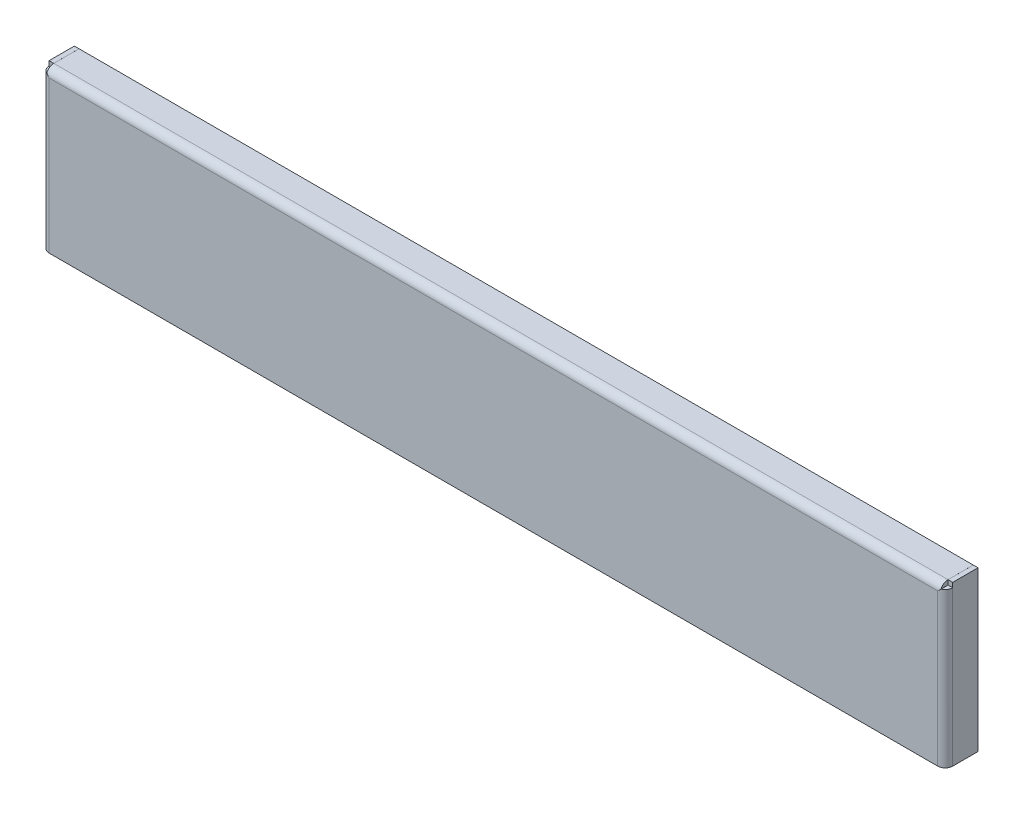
ISO-10303-21;
HEADER;
FILE_DESCRIPTION(('STEP AP214'),'2;1');
FILE_NAME('part.step','',(''),(''),'','','');
FILE_SCHEMA(('AUTOMOTIVE_DESIGN { 1 0 10303 214 1 1 1 1 }'));
ENDSEC;
DATA;
#1=APPLICATION_CONTEXT('core data for automotive mechanical design processes');
#2=APPLICATION_PROTOCOL_DEFINITION('international standard','automotive_design',2000,#1);
#3=PRODUCT_CONTEXT('',#1,'mechanical');
#4=PRODUCT('Part','Part','',(#3));
#5=PRODUCT_RELATED_PRODUCT_CATEGORY('part','',(#4));
#6=PRODUCT_DEFINITION_FORMATION('','',#4);
#7=PRODUCT_DEFINITION_CONTEXT('part definition',#1,'design');
#8=PRODUCT_DEFINITION('design','',#6,#7);
#9=PRODUCT_DEFINITION_SHAPE('','',#8);
#10=(LENGTH_UNIT() NAMED_UNIT(*) SI_UNIT(.MILLI.,.METRE.));
#11=(NAMED_UNIT(*) PLANE_ANGLE_UNIT() SI_UNIT($,.RADIAN.));
#12=(NAMED_UNIT(*) SI_UNIT($,.STERADIAN.) SOLID_ANGLE_UNIT());
#13=UNCERTAINTY_MEASURE_WITH_UNIT(LENGTH_MEASURE(1.E-05),#10,'distance_accuracy_value','');
#14=(GEOMETRIC_REPRESENTATION_CONTEXT(3) GLOBAL_UNCERTAINTY_ASSIGNED_CONTEXT((#13)) GLOBAL_UNIT_ASSIGNED_CONTEXT((#10,
#11,#12)) REPRESENTATION_CONTEXT('',''));
#15=CARTESIAN_POINT('',(0.,0.,0.));
#16=DIRECTION('',(0.,0.,1.));
#17=DIRECTION('',(1.,0.,0.));
#18=AXIS2_PLACEMENT_3D('',#15,#16,#17);
#19=CARTESIAN_POINT('',(47.85,-8.1,-0.5));
#20=DIRECTION('',(0.,-1.,0.));
#21=DIRECTION('',(1.,0.,0.));
#22=AXIS2_PLACEMENT_3D('',#19,#20,#21);
#23=PLANE('',#22);
#24=DIRECTION('',(-1.,0.,0.));
#25=VECTOR('',#24,1.);
#26=CARTESIAN_POINT('',(47.85,-8.1,0.));
#27=LINE('',#26,#25);
#28=CARTESIAN_POINT('',(47.05,-8.1,0.));
#29=VERTEX_POINT('',#28);
#30=CARTESIAN_POINT('',(-47.85,-8.1,0.));
#31=VERTEX_POINT('',#30);
#32=EDGE_CURVE('E335',#29,#31,#27,.T.);
#33=ORIENTED_EDGE('',*,*,#32,.T.);
#34=CARTESIAN_POINT('',(-47.85,-8.1,-0.8));
#35=DIRECTION('',(0.,-1.,0.));
#36=DIRECTION('',(0.,0.,-1.));
#37=AXIS2_PLACEMENT_3D('',#34,#35,#36);
#38=CIRCLE('',#37,0.8);
#39=CARTESIAN_POINT('',(-48.65,-8.1,-0.799999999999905));
#40=VERTEX_POINT('',#39);
#41=EDGE_CURVE('E279',#31,#40,#38,.T.);
#42=ORIENTED_EDGE('',*,*,#41,.T.);
#43=DIRECTION('',(0.,0.,-1.));
#44=VECTOR('',#43,1.);
#45=CARTESIAN_POINT('',(-48.65,-8.1,-0.434789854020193));
#46=LINE('',#45,#44);
#47=CARTESIAN_POINT('',(-48.65,-8.1,-3.5));
#48=VERTEX_POINT('',#47);
#49=EDGE_CURVE('E220',#40,#48,#46,.T.);
#50=ORIENTED_EDGE('',*,*,#49,.T.);
#51=DIRECTION('',(1.,0.,0.));
#52=VECTOR('',#51,1.);
#53=CARTESIAN_POINT('',(-48.65,-8.1,-3.5));
#54=LINE('',#53,#52);
#55=CARTESIAN_POINT('',(-48.15,-8.1,-3.5));
#56=VERTEX_POINT('',#55);
#57=EDGE_CURVE('E236',#48,#56,#54,.T.);
#58=ORIENTED_EDGE('',*,*,#57,.T.);
#59=DIRECTION('',(0.,0.,-1.));
#60=VECTOR('',#59,1.);
#61=CARTESIAN_POINT('',(-48.15,-8.1,-0.434789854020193));
#62=LINE('',#61,#60);
#63=CARTESIAN_POINT('',(-48.15,-8.1,-0.8));
#64=VERTEX_POINT('',#63);
#65=EDGE_CURVE('E227',#64,#56,#62,.T.);
#66=ORIENTED_EDGE('',*,*,#65,.F.);
#67=CARTESIAN_POINT('',(-47.85,-8.1,-0.8));
#68=DIRECTION('',(0.,-1.,0.));
#69=DIRECTION('',(-1.,0.,0.));
#70=AXIS2_PLACEMENT_3D('',#67,#68,#69);
#71=CIRCLE('',#70,0.3);
#72=CARTESIAN_POINT('',(-47.85,-8.1,-0.5));
#73=VERTEX_POINT('',#72);
#74=EDGE_CURVE('E283',#73,#64,#71,.T.);
#75=ORIENTED_EDGE('',*,*,#74,.F.);
#76=DIRECTION('',(-1.,0.,0.));
#77=VECTOR('',#76,1.);
#78=CARTESIAN_POINT('',(47.85,-8.1,-0.5));
#79=LINE('',#78,#77);
#80=CARTESIAN_POINT('',(47.05,-8.1,-0.5));
#81=VERTEX_POINT('',#80);
#82=EDGE_CURVE('E331',#81,#73,#79,.T.);
#83=ORIENTED_EDGE('',*,*,#82,.F.);
#84=DIRECTION('',(0.,0.,-1.));
#85=VECTOR('',#84,1.);
#86=CARTESIAN_POINT('',(47.05,-8.1,0.));
#87=LINE('',#86,#85);
#88=EDGE_CURVE('E26',#29,#81,#87,.T.);
#89=ORIENTED_EDGE('',*,*,#88,.F.);
#90=EDGE_LOOP('',(#33,#42,#50,#58,#66,#75,#83,#89));
#91=FACE_BOUND('',#90,.T.);
#92=ADVANCED_FACE('F18',(#91),#23,.T.);
#93=CARTESIAN_POINT('',(-47.85,-8.1,0.));
#94=DIRECTION('',(0.,0.,1.));
#95=DIRECTION('',(-1.,0.,0.));
#96=AXIS2_PLACEMENT_3D('',#93,#94,#95);
#97=PLANE('',#96);
#98=DIRECTION('',(1.,0.,0.));
#99=VECTOR('',#98,1.);
#100=CARTESIAN_POINT('',(-47.85,8.1,0.));
#101=LINE('',#100,#99);
#102=CARTESIAN_POINT('',(-47.85,8.1,0.));
#103=VERTEX_POINT('',#102);
#104=CARTESIAN_POINT('',(47.05,8.1,0.));
#105=VERTEX_POINT('',#104);
#106=EDGE_CURVE('E336',#103,#105,#101,.T.);
#107=ORIENTED_EDGE('',*,*,#106,.F.);
#108=DIRECTION('',(0.,1.,0.));
#109=VECTOR('',#108,1.);
#110=CARTESIAN_POINT('',(-47.85,-8.1,0.));
#111=LINE('',#110,#109);
#112=EDGE_CURVE('E33',#31,#103,#111,.T.);
#113=ORIENTED_EDGE('',*,*,#112,.F.);
#114=ORIENTED_EDGE('',*,*,#32,.F.);
#115=DIRECTION('',(0.,-1.,0.));
#116=VECTOR('',#115,1.);
#117=CARTESIAN_POINT('',(47.05,8.1,0.));
#118=LINE('',#117,#116);
#119=EDGE_CURVE('E332',#105,#29,#118,.T.);
#120=ORIENTED_EDGE('',*,*,#119,.F.);
#121=EDGE_LOOP('',(#107,#113,#114,#120));
#122=FACE_BOUND('',#121,.T.);
#123=ADVANCED_FACE('F447',(#122),#97,.T.);
#124=CARTESIAN_POINT('',(-47.85,-8.1,-0.5));
#125=DIRECTION('',(0.,0.,1.));
#126=DIRECTION('',(-1.,0.,0.));
#127=AXIS2_PLACEMENT_3D('',#124,#125,#126);
#128=PLANE('',#127);
#129=DIRECTION('',(0.,-1.,0.));
#130=VECTOR('',#129,1.);
#131=CARTESIAN_POINT('',(47.05,8.1,-0.5));
#132=LINE('',#131,#130);
#133=CARTESIAN_POINT('',(47.05,8.1,-0.5));
#134=VERTEX_POINT('',#133);
#135=EDGE_CURVE('E327',#134,#81,#132,.T.);
#136=ORIENTED_EDGE('',*,*,#135,.T.);
#137=ORIENTED_EDGE('',*,*,#82,.T.);
#138=DIRECTION('',(0.,1.,0.));
#139=VECTOR('',#138,1.);
#140=CARTESIAN_POINT('',(-47.85,-8.1,-0.5));
#141=LINE('',#140,#139);
#142=CARTESIAN_POINT('',(-47.85,8.1,-0.5));
#143=VERTEX_POINT('',#142);
#144=EDGE_CURVE('E328',#73,#143,#141,.T.);
#145=ORIENTED_EDGE('',*,*,#144,.T.);
#146=DIRECTION('',(1.,0.,0.));
#147=VECTOR('',#146,1.);
#148=CARTESIAN_POINT('',(-47.85,8.1,-0.5));
#149=LINE('',#148,#147);
#150=EDGE_CURVE('E345',#143,#134,#149,.T.);
#151=ORIENTED_EDGE('',*,*,#150,.T.);
#152=EDGE_LOOP('',(#136,#137,#145,#151));
#153=FACE_BOUND('',#152,.T.);
#154=ADVANCED_FACE('F366',(#153),#128,.F.);
#155=CARTESIAN_POINT('',(47.85,8.1,-0.8));
#156=DIRECTION('',(0.,0.,1.));
#157=DIRECTION('',(-1.,0.,0.));
#158=AXIS2_PLACEMENT_3D('',#155,#156,#157);
#159=PLANE('',#158);
#160=DIRECTION('',(0.,1.,0.));
#161=VECTOR('',#160,1.);
#162=CARTESIAN_POINT('',(47.85,-8.1,-0.8));
#163=LINE('',#162,#161);
#164=CARTESIAN_POINT('',(47.85,8.398,-0.8));
#165=VERTEX_POINT('',#164);
#166=CARTESIAN_POINT('',(47.85,8.9,-0.8));
#167=VERTEX_POINT('',#166);
#168=EDGE_CURVE('E409',#165,#167,#163,.T.);
#169=ORIENTED_EDGE('',*,*,#168,.T.);
#170=DIRECTION('',(-1.,0.,0.));
#171=VECTOR('',#170,1.);
#172=CARTESIAN_POINT('',(47.85,8.9,-0.8));
#173=LINE('',#172,#171);
#174=CARTESIAN_POINT('',(47.35,8.9,-0.8));
#175=VERTEX_POINT('',#174);
#176=EDGE_CURVE('E395',#167,#175,#173,.T.);
#177=ORIENTED_EDGE('',*,*,#176,.T.);
#178=DIRECTION('',(0.,1.,0.));
#179=VECTOR('',#178,1.);
#180=CARTESIAN_POINT('',(47.35,-8.1,-0.8));
#181=LINE('',#180,#179);
#182=CARTESIAN_POINT('',(47.35,8.398,-0.8));
#183=VERTEX_POINT('',#182);
#184=EDGE_CURVE('E307',#183,#175,#181,.T.);
#185=ORIENTED_EDGE('',*,*,#184,.F.);
#186=DIRECTION('',(-1.,0.,0.));
#187=VECTOR('',#186,1.);
#188=CARTESIAN_POINT('',(47.35,8.398,-0.8));
#189=LINE('',#188,#187);
#190=EDGE_CURVE('E298',#165,#183,#189,.T.);
#191=ORIENTED_EDGE('',*,*,#190,.F.);
#192=EDGE_LOOP('',(#169,#177,#185,#191));
#193=FACE_BOUND('',#192,.T.);
#194=ADVANCED_FACE('F430',(#193),#159,.T.);
#195=CARTESIAN_POINT('',(47.85,-8.1,-3.5));
#196=DIRECTION('',(0.,0.,-1.));
#197=DIRECTION('',(0.,-1.,0.));
#198=AXIS2_PLACEMENT_3D('',#195,#196,#197);
#199=PLANE('',#198);
#200=DIRECTION('',(0.,1.,0.));
#201=VECTOR('',#200,1.);
#202=CARTESIAN_POINT('',(47.35,-8.1,-3.5));
#203=LINE('',#202,#201);
#204=CARTESIAN_POINT('',(47.35,-8.1,-3.5));
#205=VERTEX_POINT('',#204);
#206=CARTESIAN_POINT('',(47.35,8.9,-3.5));
#207=VERTEX_POINT('',#206);
#208=EDGE_CURVE('E383',#205,#207,#203,.T.);
#209=ORIENTED_EDGE('',*,*,#208,.T.);
#210=DIRECTION('',(-1.,0.,0.));
#211=VECTOR('',#210,1.);
#212=CARTESIAN_POINT('',(47.85,8.9,-3.5));
#213=LINE('',#212,#211);
#214=CARTESIAN_POINT('',(47.85,8.9,-3.5));
#215=VERTEX_POINT('',#214);
#216=EDGE_CURVE('E401',#215,#207,#213,.T.);
#217=ORIENTED_EDGE('',*,*,#216,.F.);
#218=DIRECTION('',(0.,1.,0.));
#219=VECTOR('',#218,1.);
#220=CARTESIAN_POINT('',(47.85,-8.1,-3.5));
#221=LINE('',#220,#219);
#222=CARTESIAN_POINT('',(47.85,-8.1,-3.5));
#223=VERTEX_POINT('',#222);
#224=EDGE_CURVE('E378',#223,#215,#221,.T.);
#225=ORIENTED_EDGE('',*,*,#224,.F.);
#226=DIRECTION('',(-1.,0.,0.));
#227=VECTOR('',#226,1.);
#228=CARTESIAN_POINT('',(47.85,-8.1,-3.5));
#229=LINE('',#228,#227);
#230=EDGE_CURVE('E403',#223,#205,#229,.T.);
#231=ORIENTED_EDGE('',*,*,#230,.T.);
#232=EDGE_LOOP('',(#209,#217,#225,#231));
#233=FACE_BOUND('',#232,.T.);
#234=ADVANCED_FACE('F488',(#233),#199,.T.);
#235=CARTESIAN_POINT('',(47.85,8.9,-3.5));
#236=DIRECTION('',(0.,1.,0.));
#237=DIRECTION('',(-1.,0.,0.));
#238=AXIS2_PLACEMENT_3D('',#235,#236,#237);
#239=PLANE('',#238);
#240=DIRECTION('',(0.,0.,1.));
#241=VECTOR('',#240,1.);
#242=CARTESIAN_POINT('',(47.85,8.9,-3.5));
#243=LINE('',#242,#241);
#244=EDGE_CURVE('E425',#215,#167,#243,.T.);
#245=ORIENTED_EDGE('',*,*,#244,.F.);
#246=ORIENTED_EDGE('',*,*,#216,.T.);
#247=DIRECTION('',(0.,0.,1.));
#248=VECTOR('',#247,1.);
#249=CARTESIAN_POINT('',(47.35,8.9,-3.5));
#250=LINE('',#249,#248);
#251=EDGE_CURVE('E387',#207,#175,#250,.T.);
#252=ORIENTED_EDGE('',*,*,#251,.T.);
#253=ORIENTED_EDGE('',*,*,#176,.F.);
#254=EDGE_LOOP('',(#245,#246,#252,#253));
#255=FACE_BOUND('',#254,.T.);
#256=ADVANCED_FACE('F432',(#255),#239,.T.);
#257=CARTESIAN_POINT('',(47.35,8.1,-0.434789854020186));
#258=DIRECTION('',(-1.,0.,0.));
#259=DIRECTION('',(0.,-1.,0.));
#260=AXIS2_PLACEMENT_3D('',#257,#258,#259);
#261=PLANE('',#260);
#262=ORIENTED_EDGE('',*,*,#251,.F.);
#263=ORIENTED_EDGE('',*,*,#208,.F.);
#264=DIRECTION('',(0.,0.,-1.));
#265=VECTOR('',#264,1.);
#266=CARTESIAN_POINT('',(47.35,-8.1,-0.434789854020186));
#267=LINE('',#266,#265);
#268=CARTESIAN_POINT('',(47.35,-8.1,-0.8));
#269=VERTEX_POINT('',#268);
#270=EDGE_CURVE('E380',#269,#205,#267,.T.);
#271=ORIENTED_EDGE('',*,*,#270,.F.);
#272=EDGE_CURVE('E373',#269,#183,#181,.T.);
#273=ORIENTED_EDGE('',*,*,#272,.T.);
#274=ORIENTED_EDGE('',*,*,#184,.T.);
#275=EDGE_LOOP('',(#262,#263,#271,#273,#274));
#276=FACE_BOUND('',#275,.T.);
#277=ADVANCED_FACE('F381',(#276),#261,.T.);
#278=CARTESIAN_POINT('',(47.85,-8.1,-0.5));
#279=DIRECTION('',(0.,-1.,0.));
#280=DIRECTION('',(1.,0.,0.));
#281=AXIS2_PLACEMENT_3D('',#278,#279,#280);
#282=PLANE('',#281);
#283=ORIENTED_EDGE('',*,*,#270,.T.);
#284=ORIENTED_EDGE('',*,*,#230,.F.);
#285=DIRECTION('',(0.,0.,-1.));
#286=VECTOR('',#285,1.);
#287=CARTESIAN_POINT('',(47.85,-8.1,-0.434789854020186));
#288=LINE('',#287,#286);
#289=CARTESIAN_POINT('',(47.85,-8.1,-0.8));
#290=VERTEX_POINT('',#289);
#291=EDGE_CURVE('E393',#290,#223,#288,.T.);
#292=ORIENTED_EDGE('',*,*,#291,.F.);
#293=CARTESIAN_POINT('',(47.05,-8.1,-0.8));
#294=DIRECTION('',(0.,-1.,0.));
#295=DIRECTION('',(0.,0.,-1.));
#296=AXIS2_PLACEMENT_3D('',#293,#294,#295);
#297=CIRCLE('',#296,0.8);
#298=EDGE_CURVE('E295',#290,#29,#297,.T.);
#299=ORIENTED_EDGE('',*,*,#298,.T.);
#300=ORIENTED_EDGE('',*,*,#88,.T.);
#301=CARTESIAN_POINT('',(47.05,-8.1,-0.8));
#302=DIRECTION('',(0.,1.,0.));
#303=DIRECTION('',(0.,0.,1.));
#304=AXIS2_PLACEMENT_3D('',#301,#302,#303);
#305=CIRCLE('',#304,0.3);
#306=EDGE_CURVE('E293',#269,#81,#305,.F.);
#307=ORIENTED_EDGE('',*,*,#306,.F.);
#308=EDGE_LOOP('',(#283,#284,#292,#299,#300,#307));
#309=FACE_BOUND('',#308,.T.);
#310=ADVANCED_FACE('F358',(#309),#282,.T.);
#311=CARTESIAN_POINT('',(47.85,8.1,-0.434789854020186));
#312=DIRECTION('',(-1.,0.,0.));
#313=DIRECTION('',(0.,-1.,0.));
#314=AXIS2_PLACEMENT_3D('',#311,#312,#313);
#315=PLANE('',#314);
#316=EDGE_CURVE('E353',#290,#165,#163,.T.);
#317=ORIENTED_EDGE('',*,*,#316,.F.);
#318=ORIENTED_EDGE('',*,*,#291,.T.);
#319=ORIENTED_EDGE('',*,*,#224,.T.);
#320=ORIENTED_EDGE('',*,*,#244,.T.);
#321=ORIENTED_EDGE('',*,*,#168,.F.);
#322=EDGE_LOOP('',(#317,#318,#319,#320,#321));
#323=FACE_BOUND('',#322,.T.);
#324=ADVANCED_FACE('F487',(#323),#315,.F.);
#325=CARTESIAN_POINT('',(47.05,8.1,-0.8));
#326=DIRECTION('',(0.,-1.,0.));
#327=DIRECTION('',(0.,0.,-1.));
#328=AXIS2_PLACEMENT_3D('',#325,#326,#327);
#329=CYLINDRICAL_SURFACE('',#328,0.3);
#330=ORIENTED_EDGE('',*,*,#272,.F.);
#331=ORIENTED_EDGE('',*,*,#306,.T.);
#332=ORIENTED_EDGE('',*,*,#135,.F.);
#333=CARTESIAN_POINT('',(47.05,8.09999999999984,-0.8));
#334=DIRECTION('',(-0.704737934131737,0.709467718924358,0.));
#335=DIRECTION('',(-0.709467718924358,-0.704737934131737,0.));
#336=AXIS2_PLACEMENT_3D('',#333,#334,#335);
#337=ELLIPSE('',#336,0.422852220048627,0.3);
#338=EDGE_CURVE('E296',#183,#134,#337,.F.);
#339=ORIENTED_EDGE('',*,*,#338,.F.);
#340=EDGE_LOOP('',(#330,#331,#332,#339));
#341=FACE_BOUND('',#340,.T.);
#342=ADVANCED_FACE('F371',(#341),#329,.F.);
#343=CARTESIAN_POINT('',(47.05,8.1,-0.8));
#344=DIRECTION('',(0.,-1.,0.));
#345=DIRECTION('',(0.,0.,-1.));
#346=AXIS2_PLACEMENT_3D('',#343,#344,#345);
#347=CYLINDRICAL_SURFACE('',#346,0.8);
#348=CARTESIAN_POINT('',(47.05,8.09999999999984,-0.8));
#349=DIRECTION('',(-0.704737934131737,0.709467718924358,0.));
#350=DIRECTION('',(-0.709467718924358,-0.704737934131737,0.));
#351=AXIS2_PLACEMENT_3D('',#348,#349,#350);
#352=ELLIPSE('',#351,1.12760592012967,0.8);
#353=CARTESIAN_POINT('',(47.35,8.398,-0.0583801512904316));
#354=VERTEX_POINT('',#353);
#355=EDGE_CURVE('E301',#354,#105,#352,.F.);
#356=ORIENTED_EDGE('',*,*,#355,.T.);
#357=ORIENTED_EDGE('',*,*,#119,.T.);
#358=ORIENTED_EDGE('',*,*,#298,.F.);
#359=ORIENTED_EDGE('',*,*,#316,.T.);
#360=CARTESIAN_POINT('',(47.05,8.398,-0.8));
#361=DIRECTION('',(0.,1.,0.));
#362=DIRECTION('',(0.,0.,1.));
#363=AXIS2_PLACEMENT_3D('',#360,#361,#362);
#364=CIRCLE('',#363,0.8);
#365=EDGE_CURVE('E313',#165,#354,#364,.F.);
#366=ORIENTED_EDGE('',*,*,#365,.T.);
#367=EDGE_LOOP('',(#356,#357,#358,#359,#366));
#368=FACE_BOUND('',#367,.T.);
#369=ADVANCED_FACE('F445',(#368),#347,.T.);
#370=CARTESIAN_POINT('',(-662.417718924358,-696.637934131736,1000.));
#371=DIRECTION('',(0.704737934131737,-0.709467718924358,0.));
#372=DIRECTION('',(0.709467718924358,0.704737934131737,0.));
#373=AXIS2_PLACEMENT_3D('',#370,#371,#372);
#374=PLANE('',#373);
#375=ORIENTED_EDGE('',*,*,#338,.T.);
#376=DIRECTION('',(0.,0.,1.));
#377=VECTOR('',#376,1.);
#378=CARTESIAN_POINT('',(47.05,8.1,-0.5));
#379=LINE('',#378,#377);
#380=EDGE_CURVE('E11',#134,#105,#379,.T.);
#381=ORIENTED_EDGE('',*,*,#380,.T.);
#382=ORIENTED_EDGE('',*,*,#355,.F.);
#383=DIRECTION('',(0.,0.,-1.));
#384=VECTOR('',#383,1.);
#385=CARTESIAN_POINT('',(47.35,8.398,-1000.));
#386=LINE('',#385,#384);
#387=EDGE_CURVE('E292',#354,#183,#386,.T.);
#388=ORIENTED_EDGE('',*,*,#387,.T.);
#389=EDGE_LOOP('',(#375,#381,#382,#388));
#390=FACE_BOUND('',#389,.T.);
#391=ADVANCED_FACE('F483',(#390),#374,.F.);
#392=CARTESIAN_POINT('',(47.35,8.398,1000.));
#393=DIRECTION('',(0.,-1.,0.));
#394=DIRECTION('',(0.,0.,1.));
#395=AXIS2_PLACEMENT_3D('',#392,#393,#394);
#396=PLANE('',#395);
#397=ORIENTED_EDGE('',*,*,#190,.T.);
#398=ORIENTED_EDGE('',*,*,#387,.F.);
#399=ORIENTED_EDGE('',*,*,#365,.F.);
#400=EDGE_LOOP('',(#397,#398,#399));
#401=FACE_BOUND('',#400,.T.);
#402=ADVANCED_FACE('F485',(#401),#396,.F.);
#403=CARTESIAN_POINT('',(-47.85,-8.1,-0.8));
#404=DIRECTION('',(0.,1.,0.));
#405=DIRECTION('',(0.,0.,-1.));
#406=AXIS2_PLACEMENT_3D('',#403,#404,#405);
#407=CYLINDRICAL_SURFACE('',#406,0.8);
#408=CARTESIAN_POINT('',(-47.85,8.398,-0.8));
#409=DIRECTION('',(0.,-1.,0.));
#410=DIRECTION('',(0.,0.,-1.));
#411=AXIS2_PLACEMENT_3D('',#408,#409,#410);
#412=CIRCLE('',#411,0.8);
#413=CARTESIAN_POINT('',(-48.65,8.398,-0.800000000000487));
#414=VERTEX_POINT('',#413);
#415=CARTESIAN_POINT('',(-48.15,8.398,-0.0583801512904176));
#416=VERTEX_POINT('',#415);
#417=EDGE_CURVE('E267',#414,#416,#412,.F.);
#418=ORIENTED_EDGE('',*,*,#417,.F.);
#419=DIRECTION('',(0.,1.,0.));
#420=VECTOR('',#419,1.);
#421=CARTESIAN_POINT('',(-48.65,-8.1,-0.800000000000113));
#422=LINE('',#421,#420);
#423=EDGE_CURVE('E237',#40,#414,#422,.T.);
#424=ORIENTED_EDGE('',*,*,#423,.F.);
#425=ORIENTED_EDGE('',*,*,#41,.F.);
#426=ORIENTED_EDGE('',*,*,#112,.T.);
#427=CARTESIAN_POINT('',(-47.85,8.09999999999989,-0.8));
#428=DIRECTION('',(-0.704737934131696,-0.709467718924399,0.));
#429=DIRECTION('',(-0.709467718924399,0.704737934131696,0.));
#430=AXIS2_PLACEMENT_3D('',#427,#428,#429);
#431=ELLIPSE('',#430,1.12760592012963,0.8);
#432=EDGE_CURVE('E274',#416,#103,#431,.F.);
#433=ORIENTED_EDGE('',*,*,#432,.F.);
#434=EDGE_LOOP('',(#418,#424,#425,#426,#433));
#435=FACE_BOUND('',#434,.T.);
#436=ADVANCED_FACE('F463',(#435),#407,.T.);
#437=CARTESIAN_POINT('',(-47.85,-8.1,-0.8));
#438=DIRECTION('',(0.,1.,0.));
#439=DIRECTION('',(0.,0.,-1.));
#440=AXIS2_PLACEMENT_3D('',#437,#438,#439);
#441=CYLINDRICAL_SURFACE('',#440,0.3);
#442=CARTESIAN_POINT('',(-47.85,8.09999999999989,-0.8));
#443=DIRECTION('',(-0.704737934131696,-0.709467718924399,0.));
#444=DIRECTION('',(-0.709467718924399,0.704737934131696,0.));
#445=AXIS2_PLACEMENT_3D('',#442,#443,#444);
#446=ELLIPSE('',#445,0.422852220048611,0.3);
#447=CARTESIAN_POINT('',(-48.15,8.398,-0.8));
#448=VERTEX_POINT('',#447);
#449=EDGE_CURVE('E282',#448,#143,#446,.F.);
#450=ORIENTED_EDGE('',*,*,#449,.T.);
#451=ORIENTED_EDGE('',*,*,#144,.F.);
#452=ORIENTED_EDGE('',*,*,#74,.T.);
#453=DIRECTION('',(0.,1.,0.));
#454=VECTOR('',#453,1.);
#455=CARTESIAN_POINT('',(-48.15,-8.1,-0.800000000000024));
#456=LINE('',#455,#454);
#457=EDGE_CURVE('E278',#64,#448,#456,.T.);
#458=ORIENTED_EDGE('',*,*,#457,.T.);
#459=EDGE_LOOP('',(#450,#451,#452,#458));
#460=FACE_BOUND('',#459,.T.);
#461=ADVANCED_FACE('F475',(#460),#441,.F.);
#462=CARTESIAN_POINT('',(661.617718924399,-696.637934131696,1000.));
#463=DIRECTION('',(0.704737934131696,0.709467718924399,0.));
#464=DIRECTION('',(-0.709467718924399,0.704737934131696,0.));
#465=AXIS2_PLACEMENT_3D('',#462,#463,#464);
#466=PLANE('',#465);
#467=ORIENTED_EDGE('',*,*,#432,.T.);
#468=DIRECTION('',(-1.94289029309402E-13,0.,1.));
#469=VECTOR('',#468,1.);
#470=CARTESIAN_POINT('',(-47.85,8.1,-0.5));
#471=LINE('',#470,#469);
#472=EDGE_CURVE('E324',#143,#103,#471,.T.);
#473=ORIENTED_EDGE('',*,*,#472,.F.);
#474=ORIENTED_EDGE('',*,*,#449,.F.);
#475=DIRECTION('',(0.,0.,-1.));
#476=VECTOR('',#475,1.);
#477=CARTESIAN_POINT('',(-48.15,8.398,-1000.));
#478=LINE('',#477,#476);
#479=EDGE_CURVE('E231',#416,#448,#478,.T.);
#480=ORIENTED_EDGE('',*,*,#479,.F.);
#481=EDGE_LOOP('',(#467,#473,#474,#480));
#482=FACE_BOUND('',#481,.T.);
#483=ADVANCED_FACE('F460',(#482),#466,.T.);
#484=CARTESIAN_POINT('',(-48.15,8.398,1000.));
#485=DIRECTION('',(0.,1.,0.));
#486=DIRECTION('',(0.,0.,-1.));
#487=AXIS2_PLACEMENT_3D('',#484,#485,#486);
#488=PLANE('',#487);
#489=DIRECTION('',(-1.,0.,0.));
#490=VECTOR('',#489,1.);
#491=CARTESIAN_POINT('',(-48.65,8.398,-0.800000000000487));
#492=LINE('',#491,#490);
#493=EDGE_CURVE('E271',#448,#414,#492,.T.);
#494=ORIENTED_EDGE('',*,*,#493,.T.);
#495=ORIENTED_EDGE('',*,*,#417,.T.);
#496=ORIENTED_EDGE('',*,*,#479,.T.);
#497=EDGE_LOOP('',(#494,#495,#496));
#498=FACE_BOUND('',#497,.T.);
#499=ADVANCED_FACE('F536',(#498),#488,.T.);
#500=CARTESIAN_POINT('',(-48.65,-8.1,-3.5));
#501=DIRECTION('',(0.,0.,1.));
#502=DIRECTION('',(0.,1.,0.));
#503=AXIS2_PLACEMENT_3D('',#500,#501,#502);
#504=PLANE('',#503);
#505=DIRECTION('',(0.,1.,0.));
#506=VECTOR('',#505,1.);
#507=CARTESIAN_POINT('',(-48.15,-8.1,-3.5));
#508=LINE('',#507,#506);
#509=CARTESIAN_POINT('',(-48.15,8.9,-3.5));
#510=VERTEX_POINT('',#509);
#511=EDGE_CURVE('E232',#56,#510,#508,.T.);
#512=ORIENTED_EDGE('',*,*,#511,.F.);
#513=ORIENTED_EDGE('',*,*,#57,.F.);
#514=DIRECTION('',(0.,1.,0.));
#515=VECTOR('',#514,1.);
#516=CARTESIAN_POINT('',(-48.65,-8.1,-3.5));
#517=LINE('',#516,#515);
#518=CARTESIAN_POINT('',(-48.65,8.9,-3.5));
#519=VERTEX_POINT('',#518);
#520=EDGE_CURVE('E223',#48,#519,#517,.T.);
#521=ORIENTED_EDGE('',*,*,#520,.T.);
#522=DIRECTION('',(1.,0.,0.));
#523=VECTOR('',#522,1.);
#524=CARTESIAN_POINT('',(-48.65,8.9,-3.5));
#525=LINE('',#524,#523);
#526=EDGE_CURVE('E240',#519,#510,#525,.T.);
#527=ORIENTED_EDGE('',*,*,#526,.T.);
#528=EDGE_LOOP('',(#512,#513,#521,#527));
#529=FACE_BOUND('',#528,.T.);
#530=ADVANCED_FACE('F470',(#529),#504,.F.);
#531=CARTESIAN_POINT('',(-48.65,8.9,-3.5));
#532=DIRECTION('',(0.,-1.,0.));
#533=DIRECTION('',(1.,0.,0.));
#534=AXIS2_PLACEMENT_3D('',#531,#532,#533);
#535=PLANE('',#534);
#536=DIRECTION('',(1.,0.,0.));
#537=VECTOR('',#536,1.);
#538=CARTESIAN_POINT('',(-48.65,8.9,-0.8));
#539=LINE('',#538,#537);
#540=CARTESIAN_POINT('',(-48.65,8.9,-0.8));
#541=VERTEX_POINT('',#540);
#542=CARTESIAN_POINT('',(-48.15,8.9,-0.8));
#543=VERTEX_POINT('',#542);
#544=EDGE_CURVE('E241',#541,#543,#539,.T.);
#545=ORIENTED_EDGE('',*,*,#544,.T.);
#546=DIRECTION('',(0.,0.,1.));
#547=VECTOR('',#546,1.);
#548=CARTESIAN_POINT('',(-48.15,8.9,-3.5));
#549=LINE('',#548,#547);
#550=EDGE_CURVE('E245',#510,#543,#549,.T.);
#551=ORIENTED_EDGE('',*,*,#550,.F.);
#552=ORIENTED_EDGE('',*,*,#526,.F.);
#553=DIRECTION('',(0.,0.,1.));
#554=VECTOR('',#553,1.);
#555=CARTESIAN_POINT('',(-48.65,8.9,-3.5));
#556=LINE('',#555,#554);
#557=EDGE_CURVE('E224',#519,#541,#556,.T.);
#558=ORIENTED_EDGE('',*,*,#557,.T.);
#559=EDGE_LOOP('',(#545,#551,#552,#558));
#560=FACE_BOUND('',#559,.T.);
#561=ADVANCED_FACE('F540',(#560),#535,.F.);
#562=CARTESIAN_POINT('',(-48.65,-8.1,-0.8));
#563=DIRECTION('',(1.99276359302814E-13,0.,1.));
#564=DIRECTION('',(-1.,0.,1.99276359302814E-13));
#565=AXIS2_PLACEMENT_3D('',#562,#563,#564);
#566=PLANE('',#565);
#567=DIRECTION('',(0.,-1.,0.));
#568=VECTOR('',#567,1.);
#569=CARTESIAN_POINT('',(-48.15,8.1,-0.8));
#570=LINE('',#569,#568);
#571=EDGE_CURVE('E244',#543,#448,#570,.T.);
#572=ORIENTED_EDGE('',*,*,#571,.F.);
#573=ORIENTED_EDGE('',*,*,#544,.F.);
#574=EDGE_CURVE('E219',#414,#541,#422,.T.);
#575=ORIENTED_EDGE('',*,*,#574,.F.);
#576=ORIENTED_EDGE('',*,*,#493,.F.);
#577=EDGE_LOOP('',(#572,#573,#575,#576));
#578=FACE_BOUND('',#577,.T.);
#579=ADVANCED_FACE('F543',(#578),#566,.T.);
#580=CARTESIAN_POINT('',(-48.65,8.1,-0.434789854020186));
#581=DIRECTION('',(-1.,0.,0.));
#582=DIRECTION('',(0.,-1.,0.));
#583=AXIS2_PLACEMENT_3D('',#580,#581,#582);
#584=PLANE('',#583);
#585=ORIENTED_EDGE('',*,*,#557,.F.);
#586=ORIENTED_EDGE('',*,*,#520,.F.);
#587=ORIENTED_EDGE('',*,*,#49,.F.);
#588=ORIENTED_EDGE('',*,*,#423,.T.);
#589=ORIENTED_EDGE('',*,*,#574,.T.);
#590=EDGE_LOOP('',(#585,#586,#587,#588,#589));
#591=FACE_BOUND('',#590,.T.);
#592=ADVANCED_FACE('F467',(#591),#584,.T.);
#593=CARTESIAN_POINT('',(-48.15,8.1,-0.434789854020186));
#594=DIRECTION('',(-1.,0.,0.));
#595=DIRECTION('',(0.,-1.,0.));
#596=AXIS2_PLACEMENT_3D('',#593,#594,#595);
#597=PLANE('',#596);
#598=ORIENTED_EDGE('',*,*,#571,.T.);
#599=ORIENTED_EDGE('',*,*,#457,.F.);
#600=ORIENTED_EDGE('',*,*,#65,.T.);
#601=ORIENTED_EDGE('',*,*,#511,.T.);
#602=ORIENTED_EDGE('',*,*,#550,.T.);
#603=EDGE_LOOP('',(#598,#599,#600,#601,#602));
#604=FACE_BOUND('',#603,.T.);
#605=ADVANCED_FACE('F472',(#604),#597,.F.);
#606=CARTESIAN_POINT('',(-47.85,8.1,-0.8));
#607=DIRECTION('',(1.,0.,0.));
#608=DIRECTION('',(0.,0.,-1.));
#609=AXIS2_PLACEMENT_3D('',#606,#607,#608);
#610=CYLINDRICAL_SURFACE('',#609,0.8);
#611=CARTESIAN_POINT('',(47.348,8.1,-0.8));
#612=DIRECTION('',(-1.,0.,0.));
#613=DIRECTION('',(0.,0.,1.));
#614=AXIS2_PLACEMENT_3D('',#611,#612,#613);
#615=CIRCLE('',#614,0.8);
#616=CARTESIAN_POINT('',(47.348,8.9,-0.8));
#617=VERTEX_POINT('',#616);
#618=CARTESIAN_POINT('',(47.348,8.4,-0.0583801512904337));
#619=VERTEX_POINT('',#618);
#620=EDGE_CURVE('E196',#617,#619,#615,.F.);
#621=ORIENTED_EDGE('',*,*,#620,.F.);
#622=DIRECTION('',(-1.,0.,0.));
#623=VECTOR('',#622,1.);
#624=CARTESIAN_POINT('',(47.85,8.9,-0.8));
#625=LINE('',#624,#623);
#626=CARTESIAN_POINT('',(-48.148,8.9,-0.8));
#627=VERTEX_POINT('',#626);
#628=EDGE_CURVE('E168',#617,#627,#625,.T.);
#629=ORIENTED_EDGE('',*,*,#628,.T.);
#630=CARTESIAN_POINT('',(-48.148,8.1,-0.8));
#631=DIRECTION('',(-1.,0.,0.));
#632=DIRECTION('',(0.,0.,1.));
#633=AXIS2_PLACEMENT_3D('',#630,#631,#632);
#634=CIRCLE('',#633,0.8);
#635=CARTESIAN_POINT('',(-48.148,8.4,-0.0583801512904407));
#636=VERTEX_POINT('',#635);
#637=EDGE_CURVE('E205',#627,#636,#634,.F.);
#638=ORIENTED_EDGE('',*,*,#637,.T.);
#639=CARTESIAN_POINT('',(-47.85,8.1,-0.8));
#640=DIRECTION('',(-0.709467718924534,-0.70473793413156,0.));
#641=DIRECTION('',(0.70473793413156,-0.709467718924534,0.));
#642=AXIS2_PLACEMENT_3D('',#639,#640,#641);
#643=ELLIPSE('',#642,1.12760592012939,0.8);
#644=EDGE_CURVE('E209',#636,#103,#643,.F.);
#645=ORIENTED_EDGE('',*,*,#644,.T.);
#646=ORIENTED_EDGE('',*,*,#106,.T.);
#647=CARTESIAN_POINT('',(47.05,8.1,-0.8));
#648=DIRECTION('',(-0.709467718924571,0.704737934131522,0.));
#649=DIRECTION('',(0.704737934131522,0.709467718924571,0.));
#650=AXIS2_PLACEMENT_3D('',#647,#648,#649);
#651=ELLIPSE('',#650,1.12760592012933,0.8);
#652=EDGE_CURVE('E199',#619,#105,#651,.F.);
#653=ORIENTED_EDGE('',*,*,#652,.F.);
#654=EDGE_LOOP('',(#621,#629,#638,#645,#646,#653));
#655=FACE_BOUND('',#654,.T.);
#656=ADVANCED_FACE('F450',(#655),#610,.T.);
#657=CARTESIAN_POINT('',(-47.85,8.1,-0.8));
#658=DIRECTION('',(1.,0.,0.));
#659=DIRECTION('',(0.,0.,-1.));
#660=AXIS2_PLACEMENT_3D('',#657,#658,#659);
#661=CYLINDRICAL_SURFACE('',#660,0.3);
#662=CARTESIAN_POINT('',(47.05,8.1,-0.8));
#663=DIRECTION('',(-0.709467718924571,0.704737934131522,0.));
#664=DIRECTION('',(0.704737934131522,0.709467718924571,0.));
#665=AXIS2_PLACEMENT_3D('',#662,#663,#664);
#666=ELLIPSE('',#665,0.4228522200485,0.3);
#667=CARTESIAN_POINT('',(47.348,8.4,-0.799999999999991));
#668=VERTEX_POINT('',#667);
#669=EDGE_CURVE('E216',#668,#134,#666,.F.);
#670=ORIENTED_EDGE('',*,*,#669,.T.);
#671=ORIENTED_EDGE('',*,*,#150,.F.);
#672=CARTESIAN_POINT('',(-47.85,8.1,-0.8));
#673=DIRECTION('',(-0.709467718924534,-0.70473793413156,0.));
#674=DIRECTION('',(0.70473793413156,-0.709467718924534,0.));
#675=AXIS2_PLACEMENT_3D('',#672,#673,#674);
#676=ELLIPSE('',#675,0.422852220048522,0.3);
#677=CARTESIAN_POINT('',(-48.148,8.4,-0.8));
#678=VERTEX_POINT('',#677);
#679=EDGE_CURVE('E213',#678,#143,#676,.F.);
#680=ORIENTED_EDGE('',*,*,#679,.F.);
#681=DIRECTION('',(-1.,0.,0.));
#682=VECTOR('',#681,1.);
#683=CARTESIAN_POINT('',(47.85,8.4,-0.8));
#684=LINE('',#683,#682);
#685=EDGE_CURVE('E183',#668,#678,#684,.T.);
#686=ORIENTED_EDGE('',*,*,#685,.F.);
#687=EDGE_LOOP('',(#670,#671,#680,#686));
#688=FACE_BOUND('',#687,.T.);
#689=ADVANCED_FACE('F477',(#688),#661,.F.);
#690=CARTESIAN_POINT('',(656.887934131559,-701.367718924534,1000.));
#691=DIRECTION('',(0.709467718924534,0.70473793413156,0.));
#692=DIRECTION('',(-0.70473793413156,0.709467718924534,0.));
#693=AXIS2_PLACEMENT_3D('',#690,#691,#692);
#694=PLANE('',#693);
#695=DIRECTION('',(0.,0.,-1.));
#696=VECTOR('',#695,1.);
#697=CARTESIAN_POINT('',(-48.148,8.4,-1000.));
#698=LINE('',#697,#696);
#699=EDGE_CURVE('E202',#636,#678,#698,.T.);
#700=ORIENTED_EDGE('',*,*,#699,.T.);
#701=ORIENTED_EDGE('',*,*,#679,.T.);
#702=ORIENTED_EDGE('',*,*,#472,.T.);
#703=ORIENTED_EDGE('',*,*,#644,.F.);
#704=EDGE_LOOP('',(#700,#701,#702,#703));
#705=FACE_BOUND('',#704,.T.);
#706=ADVANCED_FACE('F455',(#705),#694,.F.);
#707=CARTESIAN_POINT('',(-48.148,8.4,1000.));
#708=DIRECTION('',(1.,0.,0.));
#709=DIRECTION('',(0.,0.,1.));
#710=AXIS2_PLACEMENT_3D('',#707,#708,#709);
#711=PLANE('',#710);
#712=ORIENTED_EDGE('',*,*,#699,.F.);
#713=ORIENTED_EDGE('',*,*,#637,.F.);
#714=DIRECTION('',(0.,0.,-1.));
#715=VECTOR('',#714,1.);
#716=CARTESIAN_POINT('',(-48.148,8.9,-0.434789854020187));
#717=LINE('',#716,#715);
#718=CARTESIAN_POINT('',(-48.148,8.9,-3.5));
#719=VERTEX_POINT('',#718);
#720=EDGE_CURVE('E162',#627,#719,#717,.T.);
#721=ORIENTED_EDGE('',*,*,#720,.T.);
#722=DIRECTION('',(0.,-1.,0.));
#723=VECTOR('',#722,1.);
#724=CARTESIAN_POINT('',(-48.148,8.9,-3.5));
#725=LINE('',#724,#723);
#726=CARTESIAN_POINT('',(-48.148,8.4,-3.5));
#727=VERTEX_POINT('',#726);
#728=EDGE_CURVE('E158',#719,#727,#725,.T.);
#729=ORIENTED_EDGE('',*,*,#728,.T.);
#730=DIRECTION('',(0.,0.,-1.));
#731=VECTOR('',#730,1.);
#732=CARTESIAN_POINT('',(-48.148,8.4,-0.434789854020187));
#733=LINE('',#732,#731);
#734=EDGE_CURVE('E161',#678,#727,#733,.T.);
#735=ORIENTED_EDGE('',*,*,#734,.F.);
#736=EDGE_LOOP('',(#712,#713,#721,#729,#735));
#737=FACE_BOUND('',#736,.T.);
#738=ADVANCED_FACE('F560',(#737),#711,.F.);
#739=CARTESIAN_POINT('',(-657.687934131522,-701.367718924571,1000.));
#740=DIRECTION('',(0.709467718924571,-0.704737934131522,0.));
#741=DIRECTION('',(0.704737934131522,0.709467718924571,0.));
#742=AXIS2_PLACEMENT_3D('',#739,#740,#741);
#743=PLANE('',#742);
#744=ORIENTED_EDGE('',*,*,#652,.T.);
#745=ORIENTED_EDGE('',*,*,#380,.F.);
#746=ORIENTED_EDGE('',*,*,#669,.F.);
#747=DIRECTION('',(0.,0.,-1.));
#748=VECTOR('',#747,1.);
#749=CARTESIAN_POINT('',(47.348,8.4,-1000.));
#750=LINE('',#749,#748);
#751=EDGE_CURVE('E191',#619,#668,#750,.T.);
#752=ORIENTED_EDGE('',*,*,#751,.F.);
#753=EDGE_LOOP('',(#744,#745,#746,#752));
#754=FACE_BOUND('',#753,.T.);
#755=ADVANCED_FACE('F482',(#754),#743,.T.);
#756=CARTESIAN_POINT('',(47.348,8.4,1000.));
#757=DIRECTION('',(1.,0.,0.));
#758=DIRECTION('',(0.,0.,1.));
#759=AXIS2_PLACEMENT_3D('',#756,#757,#758);
#760=PLANE('',#759);
#761=ORIENTED_EDGE('',*,*,#620,.T.);
#762=ORIENTED_EDGE('',*,*,#751,.T.);
#763=DIRECTION('',(0.,0.,1.));
#764=VECTOR('',#763,1.);
#765=CARTESIAN_POINT('',(47.348,8.4,-3.5));
#766=LINE('',#765,#764);
#767=CARTESIAN_POINT('',(47.348,8.4,-3.5));
#768=VERTEX_POINT('',#767);
#769=EDGE_CURVE('E172',#768,#668,#766,.T.);
#770=ORIENTED_EDGE('',*,*,#769,.F.);
#771=DIRECTION('',(0.,-1.,0.));
#772=VECTOR('',#771,1.);
#773=CARTESIAN_POINT('',(47.348,8.9,-3.5));
#774=LINE('',#773,#772);
#775=CARTESIAN_POINT('',(47.348,8.9,-3.5));
#776=VERTEX_POINT('',#775);
#777=EDGE_CURVE('E155',#776,#768,#774,.T.);
#778=ORIENTED_EDGE('',*,*,#777,.F.);
#779=DIRECTION('',(0.,0.,1.));
#780=VECTOR('',#779,1.);
#781=CARTESIAN_POINT('',(47.348,8.9,-3.5));
#782=LINE('',#781,#780);
#783=EDGE_CURVE('E165',#776,#617,#782,.T.);
#784=ORIENTED_EDGE('',*,*,#783,.T.);
#785=EDGE_LOOP('',(#761,#762,#770,#778,#784));
#786=FACE_BOUND('',#785,.T.);
#787=ADVANCED_FACE('F174',(#786),#760,.T.);
#788=CARTESIAN_POINT('',(-47.85,8.9,-3.5));
#789=DIRECTION('',(0.,0.,1.));
#790=DIRECTION('',(-1.,0.,0.));
#791=AXIS2_PLACEMENT_3D('',#788,#789,#790);
#792=PLANE('',#791);
#793=DIRECTION('',(1.,0.,0.));
#794=VECTOR('',#793,1.);
#795=CARTESIAN_POINT('',(-47.85,8.4,-3.5));
#796=LINE('',#795,#794);
#797=EDGE_CURVE('E179',#727,#768,#796,.T.);
#798=ORIENTED_EDGE('',*,*,#797,.F.);
#799=ORIENTED_EDGE('',*,*,#728,.F.);
#800=DIRECTION('',(1.,0.,0.));
#801=VECTOR('',#800,1.);
#802=CARTESIAN_POINT('',(-47.85,8.9,-3.5));
#803=LINE('',#802,#801);
#804=EDGE_CURVE('E151',#719,#776,#803,.T.);
#805=ORIENTED_EDGE('',*,*,#804,.T.);
#806=ORIENTED_EDGE('',*,*,#777,.T.);
#807=EDGE_LOOP('',(#798,#799,#805,#806));
#808=FACE_BOUND('',#807,.T.);
#809=ADVANCED_FACE('F153',(#808),#792,.F.);
#810=CARTESIAN_POINT('',(47.85,8.9,-0.434789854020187));
#811=DIRECTION('',(0.,1.,0.));
#812=DIRECTION('',(-1.,0.,0.));
#813=AXIS2_PLACEMENT_3D('',#810,#811,#812);
#814=PLANE('',#813);
#815=ORIENTED_EDGE('',*,*,#783,.F.);
#816=ORIENTED_EDGE('',*,*,#804,.F.);
#817=ORIENTED_EDGE('',*,*,#720,.F.);
#818=ORIENTED_EDGE('',*,*,#628,.F.);
#819=EDGE_LOOP('',(#815,#816,#817,#818));
#820=FACE_BOUND('',#819,.T.);
#821=ADVANCED_FACE('F166',(#820),#814,.T.);
#822=CARTESIAN_POINT('',(47.85,8.4,-0.434789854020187));
#823=DIRECTION('',(0.,1.,0.));
#824=DIRECTION('',(-1.,0.,0.));
#825=AXIS2_PLACEMENT_3D('',#822,#823,#824);
#826=PLANE('',#825);
#827=ORIENTED_EDGE('',*,*,#685,.T.);
#828=ORIENTED_EDGE('',*,*,#734,.T.);
#829=ORIENTED_EDGE('',*,*,#797,.T.);
#830=ORIENTED_EDGE('',*,*,#769,.T.);
#831=EDGE_LOOP('',(#827,#828,#829,#830));
#832=FACE_BOUND('',#831,.T.);
#833=ADVANCED_FACE('F570',(#832),#826,.F.);
#834=CLOSED_SHELL('',(#92,#123,#154,#194,#234,#256,#277,#310,#324,#342,#369,#391,#402,#436,#461,
#483,#499,#530,#561,#579,#592,#605,#656,#689,#706,#738,#755,#787,#809,#821,#833));
#835=MANIFOLD_SOLID_BREP('B1',#834);
#836=ADVANCED_BREP_SHAPE_REPRESENTATION('',(#18,#835),#14);
#837=SHAPE_DEFINITION_REPRESENTATION(#9,#836);
ENDSEC;
END-ISO-10303-21;
